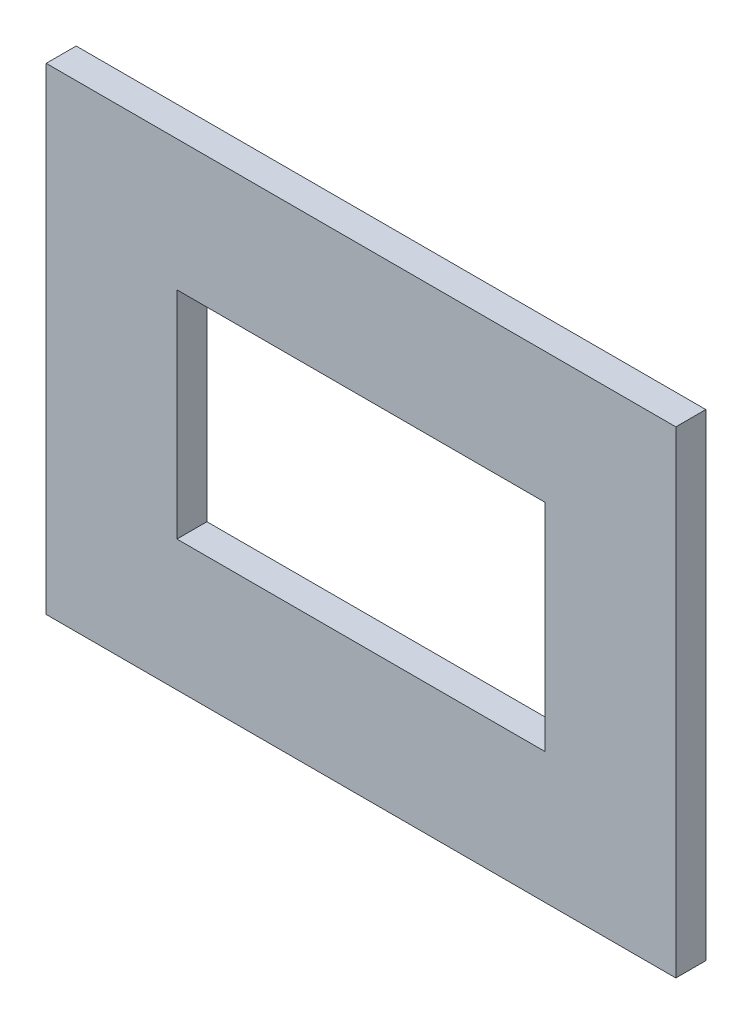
from build123d import *

# Parameters (mm, degrees)
SKETCH1_W           = 1407.485243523
SKETCH1_H           = 1128.959139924
SKETCH1_W_2         = 184.15
SKETCH1_H_2         = 107.95
BOSS_EXTRUDE1_DEPTH = 15
SKETCH2_W           = 1634.850849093
SKETCH2_H           = 1414.029762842
SKETCH2_W_2         = 382.055983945
SKETCH2_H_2         = 461.196152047
CUT_EXTRUDE1_DEPTH  = 1080.206832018
SKETCH3_W           = 382.055983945
SKETCH3_H           = 461.196152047
SKETCH3_W_2         = 314.914078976
SKETCH3_H_2         = 238.714078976
CUT_EXTRUDE2_DEPTH  = 355.870393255


with BuildPart() as part:
    # Sketch1 → Boss-Extrude1 (new body)
    with BuildSketch(Plane.XY):
        with Locations((64.619518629, -193.202426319)):
            Rectangle(SKETCH1_W, SKETCH1_H)
        Rectangle(SKETCH1_W_2, SKETCH1_H_2, mode=Mode.SUBTRACT)
    extrude(amount=BOSS_EXTRUDE1_DEPTH)

    # Sketch2 → Cut-Extrude1 (cut, through all)
    with BuildSketch(Plane(origin=(0, 0, 0), x_dir=(-1, 0, 0), z_dir=(0, 0, -1))):
        with Locations((-17.147082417, -252.403097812)):
            Rectangle(SKETCH2_W, SKETCH2_H)
        with Locations((1.955728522, -66.833058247)):
            Rectangle(SKETCH2_W_2, SKETCH2_H_2, mode=Mode.SUBTRACT)
    extrude(amount=-CUT_EXTRUDE1_DEPTH, mode=Mode.SUBTRACT)

    # Sketch3 → Cut-Extrude2 (cut, through all)
    with BuildSketch(Plane(origin=(0, 0, 0), x_dir=(-1, 0, 0), z_dir=(0, 0, -1))):
        with Locations((1.955728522, -66.833058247)):
            Rectangle(SKETCH3_W, SKETCH3_H)
        with Locations((0.017960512, 0.017960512)):
            Rectangle(SKETCH3_W_2, SKETCH3_H_2, mode=Mode.SUBTRACT)
    extrude(amount=-CUT_EXTRUDE2_DEPTH, mode=Mode.SUBTRACT)


solid = part.part
